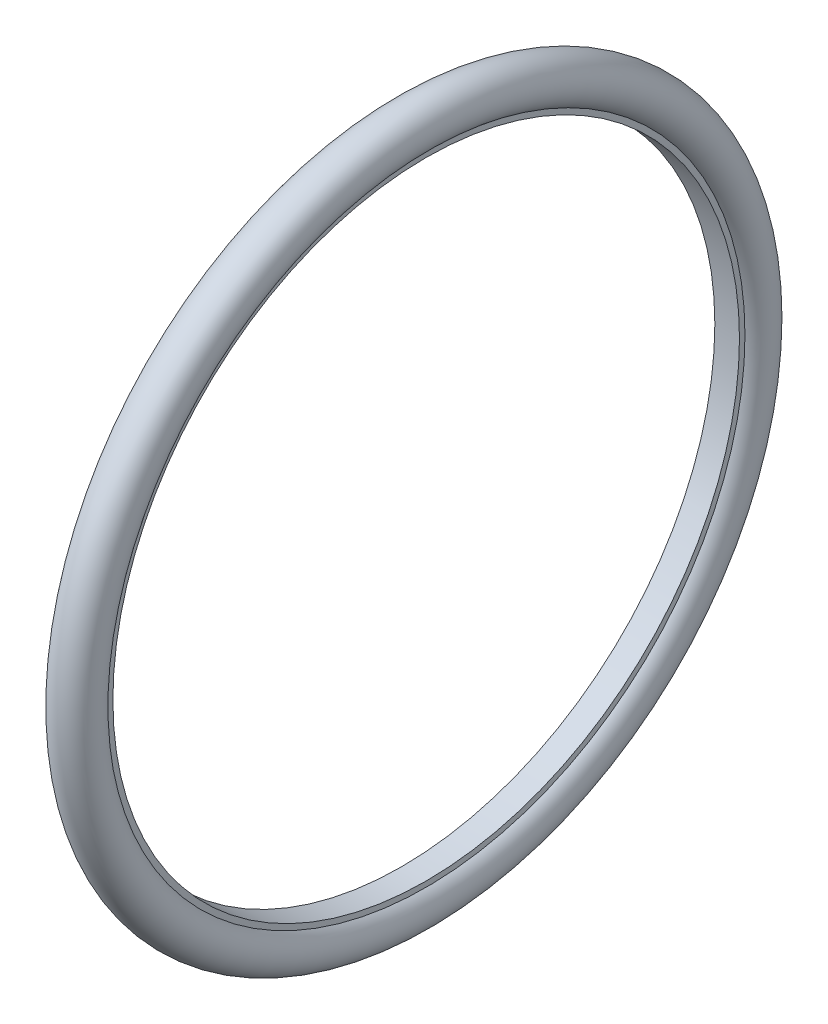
from build123d import *


with BuildPart() as part:
    # Esquisse1 → R_volution1 (revolve)
    with BuildSketch(Plane.XY, mode=Mode.PRIVATE) as r_volution1_sk:
        with BuildLine():
            Line((49.05, 290), (49.05, 285))
            Line((49.05, 285), (71.45, 285))
            Line((71.45, 285), (71.45, 290))
            ThreePointArc((71.45, 290), (60.25, 326.569852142), (49.05, 290))
        make_face()
    revolve(r_volution1_sk.sketch.rotate(Axis((88.70113152, 0, 0), (-1, 0, 0)), 90), axis=Axis((88.70113152, 0, 0), (-1, 0, 0)))


solid = part.part
